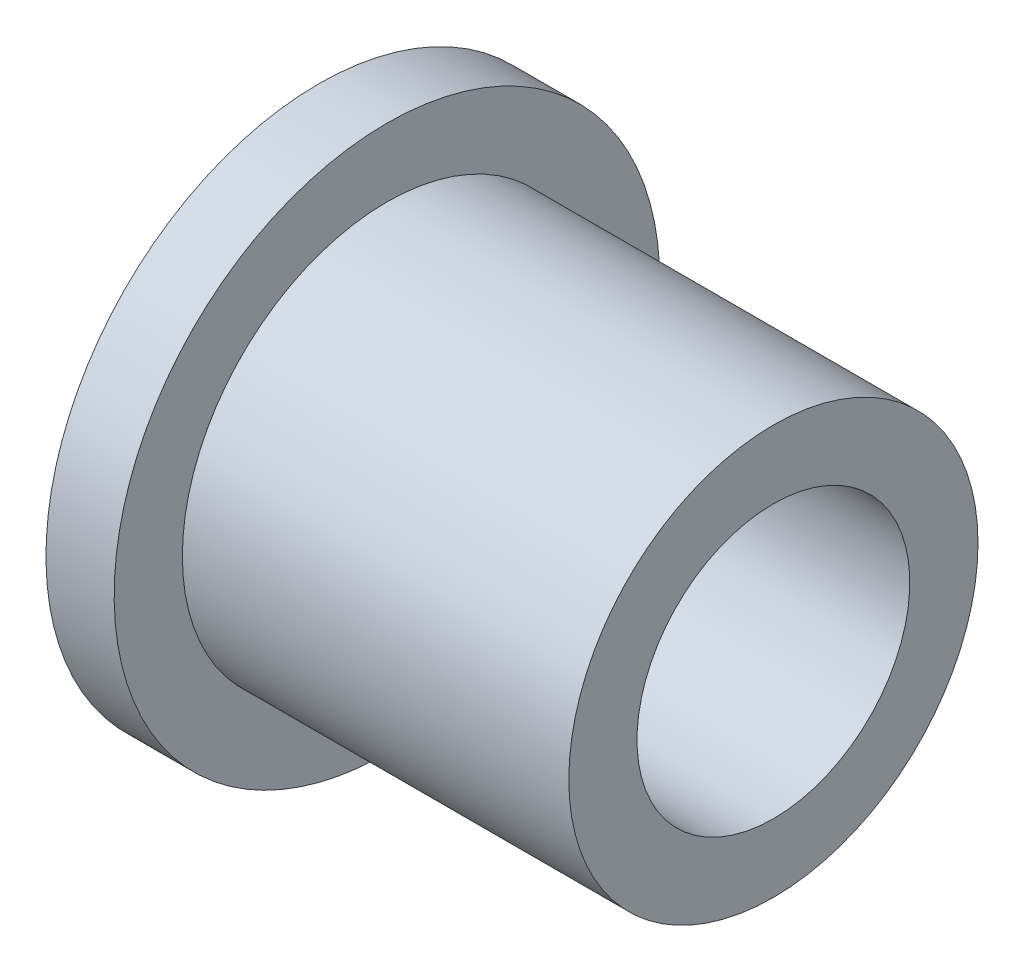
from build123d import *


with BuildPart() as part:
    # Schizzo1 → Rivoluzione1 (revolve)
    with BuildSketch(Plane.XY):
        Polygon((-20, 6), (-20, 12), (-17, 12), (-17, 9), (0, 9), (0, 6), align=None)
    revolve(axis=Axis((0, 0, 0), (-1, 0, 0)))


solid = part.part
